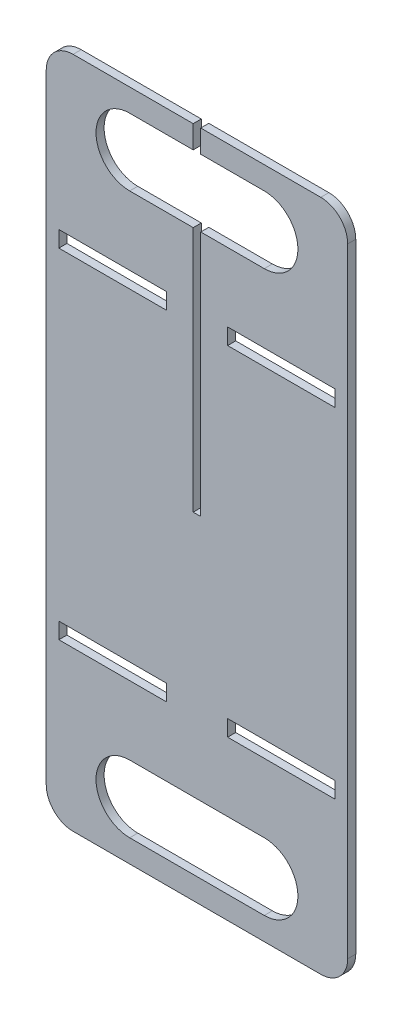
from build123d import *

# Parameters (mm, degrees)
BOSS_EXTRUDE1_DEPTH = 3
SKETCH2_W           = 39.9
SKETCH2_H           = 6
CUT_EXTRUDE1_DEPTH  = 138.003649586
FILLET1_R           = 10
CUT_EXTRUDE2_DEPTH  = 138.003649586


with BuildPart() as part:
    # Sketch1 → Boss-Extrude1 (new body)
    with BuildSketch(Plane.XY):
        Polygon((1.4, 125), (56, 125), (56, -125), (-56, -125), (-56, 125), (-1.4, 125), (-1.4, 0), (1.4, 0), align=None)
    extrude(amount=BOSS_EXTRUDE1_DEPTH)

    # Sketch2 → Cut-Extrude1 (cut, through all)
    with BuildSketch(Plane(origin=(0, 0, 0), x_dir=(-1, 0, 0), z_dir=(0, 0, -1))):
        with Locations((-31.35, 63)):
            Rectangle(SKETCH2_W, SKETCH2_H)
        with Locations((-31.35, -63)):
            Rectangle(SKETCH2_W, SKETCH2_H)
    cut_extrude1 = extrude(amount=-CUT_EXTRUDE1_DEPTH, mode=Mode.SUBTRACT)

    # Mirror1: Cut-Extrude1 across plane
    add(cut_extrude1.mirror(Plane(origin=(0, 0, 0), x_dir=(0, 0, 1), z_dir=(1, 0, 0))), mode=Mode.SUBTRACT)

    # Fillet1
    fillet1_edges = [part.edges().sort_by_distance(p)[0] for p in [
        (56, -125, 1.5),
        (-56, -125, 1.5),
        (-56, 125, 1.5),
        (56, 125, 1.5),
    ]]
    fillet(fillet1_edges, radius=FILLET1_R)

    # Sketch3 → Cut-Extrude2 (cut, through all)
    with BuildSketch(Plane(origin=(0, 0, 0), x_dir=(-1, 0, 0), z_dir=(0, 0, -1))):
        with BuildLine():
            Line((-25, -91.553547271), (25, -91.553547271))
            ThreePointArc((25, -91.553547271), (37.5, -104.053547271), (25, -116.553547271))
            Line((25, -116.553547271), (-25, -116.553547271))
            ThreePointArc((-25, -116.553547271), (-37.5, -104.053547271), (-25, -91.553547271))
        make_face()
    cut_extrude2 = extrude(amount=-CUT_EXTRUDE2_DEPTH, mode=Mode.SUBTRACT)

    # Mirror2: Cut-Extrude2 across plane
    add(cut_extrude2.mirror(Plane.ZX), mode=Mode.SUBTRACT)


solid = part.part
